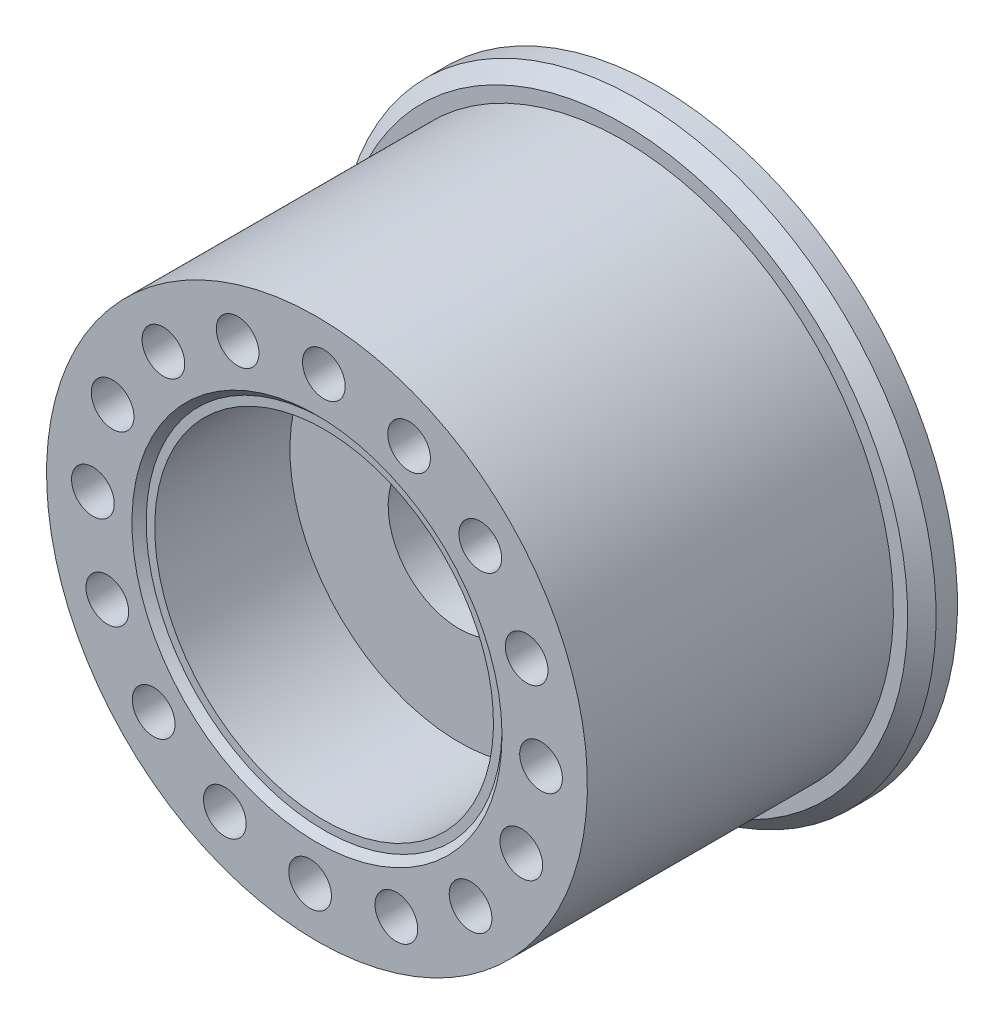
ISO-10303-21;
HEADER;
FILE_DESCRIPTION(('STEP AP214'),'2;1');
FILE_NAME('part.step','',(''),(''),'','','');
FILE_SCHEMA(('AUTOMOTIVE_DESIGN { 1 0 10303 214 1 1 1 1 }'));
ENDSEC;
DATA;
#1=APPLICATION_CONTEXT('core data for automotive mechanical design processes');
#2=APPLICATION_PROTOCOL_DEFINITION('international standard','automotive_design',2000,#1);
#3=PRODUCT_CONTEXT('',#1,'mechanical');
#4=PRODUCT('Part','Part','',(#3));
#5=PRODUCT_RELATED_PRODUCT_CATEGORY('part','',(#4));
#6=PRODUCT_DEFINITION_FORMATION('','',#4);
#7=PRODUCT_DEFINITION_CONTEXT('part definition',#1,'design');
#8=PRODUCT_DEFINITION('design','',#6,#7);
#9=PRODUCT_DEFINITION_SHAPE('','',#8);
#10=(LENGTH_UNIT() NAMED_UNIT(*) SI_UNIT(.MILLI.,.METRE.));
#11=(NAMED_UNIT(*) PLANE_ANGLE_UNIT() SI_UNIT($,.RADIAN.));
#12=(NAMED_UNIT(*) SI_UNIT($,.STERADIAN.) SOLID_ANGLE_UNIT());
#13=UNCERTAINTY_MEASURE_WITH_UNIT(LENGTH_MEASURE(1.E-05),#10,'distance_accuracy_value','');
#14=(GEOMETRIC_REPRESENTATION_CONTEXT(3) GLOBAL_UNCERTAINTY_ASSIGNED_CONTEXT((#13)) GLOBAL_UNIT_ASSIGNED_CONTEXT((#10,
#11,#12)) REPRESENTATION_CONTEXT('',''));
#15=CARTESIAN_POINT('',(0.,0.,0.));
#16=DIRECTION('',(0.,0.,1.));
#17=DIRECTION('',(1.,0.,0.));
#18=AXIS2_PLACEMENT_3D('',#15,#16,#17);
#19=CARTESIAN_POINT('',(780.987697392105,135.57859950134,19.999999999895));
#20=DIRECTION('',(0.,0.,-1.));
#21=DIRECTION('',(-0.99952767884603,0.0307314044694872,0.));
#22=AXIS2_PLACEMENT_3D('',#19,#20,#21);
#23=PLANE('',#22);
#24=CARTESIAN_POINT('',(780.621993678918,123.684220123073,19.999999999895));
#25=DIRECTION('',(0.,0.,-1.));
#26=DIRECTION('',(-0.99952767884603,0.0307314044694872,0.));
#27=AXIS2_PLACEMENT_3D('',#24,#25,#26);
#28=CIRCLE('',#27,5.);
#29=CARTESIAN_POINT('',(775.624355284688,123.83787714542,19.999999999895));
#30=VERTEX_POINT('',#29);
#31=EDGE_CURVE('E60',#30,#30,#28,.T.);
#32=ORIENTED_EDGE('',*,*,#31,.T.);
#33=EDGE_LOOP('',(#32));
#34=FACE_BOUND('',#33,.T.);
#35=CARTESIAN_POINT('',(780.621993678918,123.684220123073,19.999999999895));
#36=DIRECTION('',(0.,0.,-1.));
#37=DIRECTION('',(-0.99952767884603,0.0307314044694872,0.));
#38=AXIS2_PLACEMENT_3D('',#35,#36,#37);
#39=CIRCLE('',#38,11.9);
#40=CARTESIAN_POINT('',(768.72761430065,124.049923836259,19.999999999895));
#41=VERTEX_POINT('',#40);
#42=EDGE_CURVE('E10',#41,#41,#39,.T.);
#43=ORIENTED_EDGE('',*,*,#42,.F.);
#44=EDGE_LOOP('',(#43));
#45=FACE_BOUND('',#44,.T.);
#46=ADVANCED_FACE('F14',(#34,#45),#23,.F.);
#47=CARTESIAN_POINT('',(780.621993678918,123.684220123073,0.363724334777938));
#48=DIRECTION('',(0.,0.,-1.));
#49=DIRECTION('',(-0.99952767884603,0.0307314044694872,0.));
#50=AXIS2_PLACEMENT_3D('',#47,#48,#49);
#51=CYLINDRICAL_SURFACE('',#50,11.9);
#52=CARTESIAN_POINT('',(780.621993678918,123.684220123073,29.4999999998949));
#53=DIRECTION('',(0.,0.,-1.));
#54=DIRECTION('',(-0.99952767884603,0.0307314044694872,0.));
#55=AXIS2_PLACEMENT_3D('',#52,#53,#54);
#56=CIRCLE('',#55,11.9);
#57=CARTESIAN_POINT('',(768.72761430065,124.049923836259,29.4999999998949));
#58=VERTEX_POINT('',#57);
#59=EDGE_CURVE('E20',#58,#58,#56,.T.);
#60=ORIENTED_EDGE('',*,*,#59,.F.);
#61=EDGE_LOOP('',(#60));
#62=FACE_BOUND('',#61,.T.);
#63=ORIENTED_EDGE('',*,*,#42,.T.);
#64=EDGE_LOOP('',(#63));
#65=FACE_BOUND('',#64,.T.);
#66=ADVANCED_FACE('F212',(#62,#65),#51,.F.);
#67=CARTESIAN_POINT('',(781.006136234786,136.178316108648,29.4999999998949));
#68=DIRECTION('',(0.,0.,-1.));
#69=DIRECTION('',(-0.99952767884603,0.0307314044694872,0.));
#70=AXIS2_PLACEMENT_3D('',#67,#68,#69);
#71=PLANE('',#70);
#72=CARTESIAN_POINT('',(780.621993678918,123.684220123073,29.4999999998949));
#73=DIRECTION('',(0.,0.,-1.));
#74=DIRECTION('',(-0.99952767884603,0.0307314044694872,0.));
#75=AXIS2_PLACEMENT_3D('',#72,#73,#74);
#76=CIRCLE('',#75,12.5);
#77=CARTESIAN_POINT('',(768.127897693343,124.068362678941,29.4999999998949));
#78=VERTEX_POINT('',#77);
#79=EDGE_CURVE('E24',#78,#78,#76,.T.);
#80=ORIENTED_EDGE('',*,*,#79,.F.);
#81=EDGE_LOOP('',(#80));
#82=FACE_BOUND('',#81,.T.);
#83=ORIENTED_EDGE('',*,*,#59,.T.);
#84=EDGE_LOOP('',(#83));
#85=FACE_BOUND('',#84,.T.);
#86=ADVANCED_FACE('F207',(#82,#85),#71,.F.);
#87=CARTESIAN_POINT('',(780.621993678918,123.684220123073,29.4999999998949));
#88=DIRECTION('',(0.,0.,1.));
#89=DIRECTION('',(0.99952767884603,-0.0307314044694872,0.));
#90=AXIS2_PLACEMENT_3D('',#87,#88,#89);
#91=CONICAL_SURFACE('',#90,12.5,0.785398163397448);
#92=CARTESIAN_POINT('',(780.621993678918,123.684220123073,29.999999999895));
#93=DIRECTION('',(0.,0.,-1.));
#94=DIRECTION('',(-0.99952767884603,0.0307314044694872,0.));
#95=AXIS2_PLACEMENT_3D('',#92,#93,#94);
#96=CIRCLE('',#95,13.);
#97=CARTESIAN_POINT('',(767.62813385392,124.083728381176,29.999999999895));
#98=VERTEX_POINT('',#97);
#99=EDGE_CURVE('E28',#98,#98,#96,.T.);
#100=ORIENTED_EDGE('',*,*,#99,.F.);
#101=EDGE_LOOP('',(#100));
#102=FACE_BOUND('',#101,.T.);
#103=ORIENTED_EDGE('',*,*,#79,.T.);
#104=EDGE_LOOP('',(#103));
#105=FACE_BOUND('',#104,.T.);
#106=ADVANCED_FACE('F169',(#102,#105),#91,.F.);
#107=CARTESIAN_POINT('',(781.036867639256,137.177843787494,29.999999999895));
#108=DIRECTION('',(0.,0.,-1.));
#109=DIRECTION('',(-0.99952767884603,0.0307314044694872,0.));
#110=AXIS2_PLACEMENT_3D('',#107,#108,#109);
#111=PLANE('',#110);
#112=CARTESIAN_POINT('',(775.0447522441,138.413676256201,29.999999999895));
#113=DIRECTION('',(0.,0.,1.));
#114=DIRECTION('',(0.93520356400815,0.354110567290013,0.));
#115=AXIS2_PLACEMENT_3D('',#112,#113,#114);
#116=CIRCLE('',#115,1.5);
#117=CARTESIAN_POINT('',(776.447557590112,138.944842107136,29.999999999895));
#118=VERTEX_POINT('',#117);
#119=EDGE_CURVE('E159',#118,#118,#116,.T.);
#120=ORIENTED_EDGE('',*,*,#119,.F.);
#121=EDGE_LOOP('',(#120));
#122=FACE_BOUND('',#121,.T.);
#123=CARTESIAN_POINT('',(769.832575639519,135.158145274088,29.999999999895));
#124=DIRECTION('',(0.,0.,1.));
#125=DIRECTION('',(0.728503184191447,0.685042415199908,0.));
#126=AXIS2_PLACEMENT_3D('',#123,#124,#125);
#127=CIRCLE('',#126,1.5);
#128=CARTESIAN_POINT('',(770.925330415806,136.185708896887,29.999999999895));
#129=VERTEX_POINT('',#128);
#130=EDGE_CURVE('E153',#129,#129,#127,.T.);
#131=ORIENTED_EDGE('',*,*,#130,.F.);
#132=EDGE_LOOP('',(#131));
#133=FACE_BOUND('',#132,.T.);
#134=CARTESIAN_POINT('',(766.262990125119,130.155813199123,29.999999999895));
#135=DIRECTION('',(0.,0.,1.));
#136=DIRECTION('',(0.410894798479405,0.911682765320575,0.));
#137=AXIS2_PLACEMENT_3D('',#134,#135,#136);
#138=CIRCLE('',#137,1.5);
#139=CARTESIAN_POINT('',(766.879332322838,131.523337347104,29.999999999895));
#140=VERTEX_POINT('',#139);
#141=EDGE_CURVE('E147',#140,#140,#138,.T.);
#142=ORIENTED_EDGE('',*,*,#141,.F.);
#143=EDGE_LOOP('',(#142));
#144=FACE_BOUND('',#143,.T.);
#145=CARTESIAN_POINT('',(764.879432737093,124.168239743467,29.999999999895));
#146=DIRECTION('',(0.,0.,1.));
#147=DIRECTION('',(0.0307314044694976,0.99952767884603,0.));
#148=AXIS2_PLACEMENT_3D('',#145,#146,#147);
#149=CIRCLE('',#148,1.5);
#150=CARTESIAN_POINT('',(764.925529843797,125.667531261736,29.999999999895));
#151=VERTEX_POINT('',#150);
#152=EDGE_CURVE('E141',#151,#151,#149,.T.);
#153=ORIENTED_EDGE('',*,*,#152,.F.);
#154=EDGE_LOOP('',(#153));
#155=FACE_BOUND('',#154,.T.);
#156=CARTESIAN_POINT('',(765.892537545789,118.106978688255,29.999999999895));
#157=DIRECTION('',(0.,0.,1.));
#158=DIRECTION('',(-0.354110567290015,0.935203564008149,0.));
#159=AXIS2_PLACEMENT_3D('',#156,#157,#158);
#160=CIRCLE('',#159,1.5);
#161=CARTESIAN_POINT('',(765.361371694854,119.509784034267,29.999999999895));
#162=VERTEX_POINT('',#161);
#163=EDGE_CURVE('E135',#162,#162,#160,.T.);
#164=ORIENTED_EDGE('',*,*,#163,.F.);
#165=EDGE_LOOP('',(#164));
#166=FACE_BOUND('',#165,.T.);
#167=CARTESIAN_POINT('',(769.148068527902,112.894802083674,29.999999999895));
#168=DIRECTION('',(0.,0.,1.));
#169=DIRECTION('',(-0.68504241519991,0.728503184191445,0.));
#170=AXIS2_PLACEMENT_3D('',#167,#168,#169);
#171=CIRCLE('',#170,1.5);
#172=CARTESIAN_POINT('',(768.120504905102,113.987556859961,29.999999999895));
#173=VERTEX_POINT('',#172);
#174=EDGE_CURVE('E129',#173,#173,#171,.T.);
#175=ORIENTED_EDGE('',*,*,#174,.F.);
#176=EDGE_LOOP('',(#175));
#177=FACE_BOUND('',#176,.T.);
#178=CARTESIAN_POINT('',(774.150400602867,109.325216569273,29.999999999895));
#179=DIRECTION('',(0.,0.,1.));
#180=DIRECTION('',(-0.911682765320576,0.410894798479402,0.));
#181=AXIS2_PLACEMENT_3D('',#178,#179,#180);
#182=CIRCLE('',#181,1.5);
#183=CARTESIAN_POINT('',(772.782876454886,109.941558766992,29.999999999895));
#184=VERTEX_POINT('',#183);
#185=EDGE_CURVE('E123',#184,#184,#182,.T.);
#186=ORIENTED_EDGE('',*,*,#185,.F.);
#187=EDGE_LOOP('',(#186));
#188=FACE_BOUND('',#187,.T.);
#189=CARTESIAN_POINT('',(780.137974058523,107.941659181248,29.999999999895));
#190=DIRECTION('',(0.,0.,1.));
#191=DIRECTION('',(-0.99952767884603,0.0307314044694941,0.));
#192=AXIS2_PLACEMENT_3D('',#189,#190,#191);
#193=CIRCLE('',#192,1.5);
#194=CARTESIAN_POINT('',(778.638682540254,107.987756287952,29.999999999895));
#195=VERTEX_POINT('',#194);
#196=EDGE_CURVE('E117',#195,#195,#193,.T.);
#197=ORIENTED_EDGE('',*,*,#196,.F.);
#198=EDGE_LOOP('',(#197));
#199=FACE_BOUND('',#198,.T.);
#200=CARTESIAN_POINT('',(786.199235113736,108.954763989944,29.999999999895));
#201=DIRECTION('',(0.,0.,1.));
#202=DIRECTION('',(-0.935203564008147,-0.354110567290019,0.));
#203=AXIS2_PLACEMENT_3D('',#200,#201,#202);
#204=CIRCLE('',#203,1.5);
#205=CARTESIAN_POINT('',(784.796429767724,108.423598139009,29.999999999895));
#206=VERTEX_POINT('',#205);
#207=EDGE_CURVE('E111',#206,#206,#204,.T.);
#208=ORIENTED_EDGE('',*,*,#207,.F.);
#209=EDGE_LOOP('',(#208));
#210=FACE_BOUND('',#209,.T.);
#211=CARTESIAN_POINT('',(791.411411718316,112.210294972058,29.999999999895));
#212=DIRECTION('',(0.,0.,1.));
#213=DIRECTION('',(-0.728503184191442,-0.685042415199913,0.));
#214=AXIS2_PLACEMENT_3D('',#211,#212,#213);
#215=CIRCLE('',#214,1.5);
#216=CARTESIAN_POINT('',(790.318656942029,111.182731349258,29.999999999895));
#217=VERTEX_POINT('',#216);
#218=EDGE_CURVE('E105',#217,#217,#215,.T.);
#219=ORIENTED_EDGE('',*,*,#218,.F.);
#220=EDGE_LOOP('',(#219));
#221=FACE_BOUND('',#220,.T.);
#222=CARTESIAN_POINT('',(794.980997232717,117.212627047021,29.999999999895));
#223=DIRECTION('',(0.,0.,1.));
#224=DIRECTION('',(-0.4108947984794,-0.911682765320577,0.));
#225=AXIS2_PLACEMENT_3D('',#222,#223,#224);
#226=CIRCLE('',#225,1.5);
#227=CARTESIAN_POINT('',(794.364655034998,115.845102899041,29.999999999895));
#228=VERTEX_POINT('',#227);
#229=EDGE_CURVE('E99',#228,#228,#226,.T.);
#230=ORIENTED_EDGE('',*,*,#229,.F.);
#231=EDGE_LOOP('',(#230));
#232=FACE_BOUND('',#231,.T.);
#233=CARTESIAN_POINT('',(796.364554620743,123.200200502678,29.999999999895));
#234=DIRECTION('',(0.,0.,1.));
#235=DIRECTION('',(-0.0307314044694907,-0.99952767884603,0.));
#236=AXIS2_PLACEMENT_3D('',#233,#234,#235);
#237=CIRCLE('',#236,1.5);
#238=CARTESIAN_POINT('',(796.318457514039,121.700908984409,29.999999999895));
#239=VERTEX_POINT('',#238);
#240=EDGE_CURVE('E93',#239,#239,#237,.T.);
#241=ORIENTED_EDGE('',*,*,#240,.F.);
#242=EDGE_LOOP('',(#241));
#243=FACE_BOUND('',#242,.T.);
#244=CARTESIAN_POINT('',(795.351449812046,129.26146155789,29.999999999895));
#245=DIRECTION('',(0.,0.,1.));
#246=DIRECTION('',(0.354110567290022,-0.935203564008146,0.));
#247=AXIS2_PLACEMENT_3D('',#244,#245,#246);
#248=CIRCLE('',#247,1.5);
#249=CARTESIAN_POINT('',(795.882615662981,127.858656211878,29.999999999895));
#250=VERTEX_POINT('',#249);
#251=EDGE_CURVE('E87',#250,#250,#248,.T.);
#252=ORIENTED_EDGE('',*,*,#251,.F.);
#253=EDGE_LOOP('',(#252));
#254=FACE_BOUND('',#253,.T.);
#255=CARTESIAN_POINT('',(792.095918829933,134.473638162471,29.999999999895));
#256=DIRECTION('',(0.,0.,1.));
#257=DIRECTION('',(0.685042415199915,-0.72850318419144,0.));
#258=AXIS2_PLACEMENT_3D('',#255,#256,#257);
#259=CIRCLE('',#258,1.5);
#260=CARTESIAN_POINT('',(793.123482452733,133.380883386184,29.999999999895));
#261=VERTEX_POINT('',#260);
#262=EDGE_CURVE('E81',#261,#261,#259,.T.);
#263=ORIENTED_EDGE('',*,*,#262,.F.);
#264=EDGE_LOOP('',(#263));
#265=FACE_BOUND('',#264,.T.);
#266=CARTESIAN_POINT('',(787.093586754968,138.043223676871,29.999999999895));
#267=DIRECTION('',(0.,0.,1.));
#268=DIRECTION('',(0.911682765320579,-0.410894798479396,0.));
#269=AXIS2_PLACEMENT_3D('',#266,#267,#268);
#270=CIRCLE('',#269,1.5);
#271=CARTESIAN_POINT('',(788.461110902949,137.426881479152,29.999999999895));
#272=VERTEX_POINT('',#271);
#273=EDGE_CURVE('E75',#272,#272,#270,.T.);
#274=ORIENTED_EDGE('',*,*,#273,.F.);
#275=EDGE_LOOP('',(#274));
#276=FACE_BOUND('',#275,.T.);
#277=CARTESIAN_POINT('',(781.106013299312,139.426781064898,29.999999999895));
#278=DIRECTION('',(0.,0.,1.));
#279=DIRECTION('',(0.99952767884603,-0.0307314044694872,0.));
#280=AXIS2_PLACEMENT_3D('',#277,#278,#279);
#281=CIRCLE('',#280,1.5);
#282=CARTESIAN_POINT('',(782.605304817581,139.380683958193,29.999999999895));
#283=VERTEX_POINT('',#282);
#284=EDGE_CURVE('E69',#283,#283,#281,.T.);
#285=ORIENTED_EDGE('',*,*,#284,.F.);
#286=EDGE_LOOP('',(#285));
#287=FACE_BOUND('',#286,.T.);
#288=CARTESIAN_POINT('',(780.621993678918,123.684220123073,29.999999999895));
#289=DIRECTION('',(0.,0.,-1.));
#290=DIRECTION('',(-0.99952767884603,0.0307314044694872,0.));
#291=AXIS2_PLACEMENT_3D('',#288,#289,#290);
#292=CIRCLE('',#291,19.);
#293=CARTESIAN_POINT('',(761.630967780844,124.268116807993,29.999999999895));
#294=VERTEX_POINT('',#293);
#295=EDGE_CURVE('E33',#294,#294,#292,.T.);
#296=ORIENTED_EDGE('',*,*,#295,.F.);
#297=EDGE_LOOP('',(#296));
#298=FACE_BOUND('',#297,.T.);
#299=ORIENTED_EDGE('',*,*,#99,.T.);
#300=EDGE_LOOP('',(#299));
#301=FACE_BOUND('',#300,.T.);
#302=ADVANCED_FACE('F165',(#122,#133,#144,#155,#166,#177,#188,#199,#210,#221,#232,#243,#254,
#265,#276,#287,#298,#301),#111,.F.);
#303=CARTESIAN_POINT('',(780.621993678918,123.684220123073,0.363724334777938));
#304=DIRECTION('',(0.,0.,-1.));
#305=DIRECTION('',(-0.99952767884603,0.0307314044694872,0.));
#306=AXIS2_PLACEMENT_3D('',#303,#304,#305);
#307=CYLINDRICAL_SURFACE('',#306,19.);
#308=CARTESIAN_POINT('',(780.621993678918,123.684220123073,8.49999999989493));
#309=DIRECTION('',(0.,0.,-1.));
#310=DIRECTION('',(-0.99952767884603,0.0307314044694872,0.));
#311=AXIS2_PLACEMENT_3D('',#308,#309,#310);
#312=CIRCLE('',#311,19.);
#313=CARTESIAN_POINT('',(761.630967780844,124.268116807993,8.49999999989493));
#314=VERTEX_POINT('',#313);
#315=EDGE_CURVE('E36',#314,#314,#312,.T.);
#316=ORIENTED_EDGE('',*,*,#315,.F.);
#317=EDGE_LOOP('',(#316));
#318=FACE_BOUND('',#317,.T.);
#319=ORIENTED_EDGE('',*,*,#295,.T.);
#320=EDGE_LOOP('',(#319));
#321=FACE_BOUND('',#320,.T.);
#322=ADVANCED_FACE('F168',(#318,#321),#307,.T.);
#323=CARTESIAN_POINT('',(781.236621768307,143.674773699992,8.49999999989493));
#324=DIRECTION('',(0.,0.,-1.));
#325=DIRECTION('',(-0.99952767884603,0.0307314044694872,0.));
#326=AXIS2_PLACEMENT_3D('',#323,#324,#325);
#327=PLANE('',#326);
#328=CARTESIAN_POINT('',(780.621993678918,123.684220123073,8.49999999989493));
#329=DIRECTION('',(0.,0.,-1.));
#330=DIRECTION('',(-0.99952767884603,0.0307314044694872,0.));
#331=AXIS2_PLACEMENT_3D('',#328,#329,#330);
#332=CIRCLE('',#331,19.9999999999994);
#333=CARTESIAN_POINT('',(760.631440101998,124.298848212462,8.49999999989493));
#334=VERTEX_POINT('',#333);
#335=EDGE_CURVE('E39',#334,#334,#332,.T.);
#336=ORIENTED_EDGE('',*,*,#335,.F.);
#337=EDGE_LOOP('',(#336));
#338=FACE_BOUND('',#337,.T.);
#339=ORIENTED_EDGE('',*,*,#315,.T.);
#340=EDGE_LOOP('',(#339));
#341=FACE_BOUND('',#340,.T.);
#342=ADVANCED_FACE('F266',(#338,#341),#327,.F.);
#343=CARTESIAN_POINT('',(780.621993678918,123.684220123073,8.49999999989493));
#344=DIRECTION('',(0.,0.,-1.));
#345=DIRECTION('',(-0.99952767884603,0.0307314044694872,0.));
#346=AXIS2_PLACEMENT_3D('',#343,#344,#345);
#347=CONICAL_SURFACE('',#346,19.9999999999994,0.785398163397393);
#348=CARTESIAN_POINT('',(780.621993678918,123.684220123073,7.49999999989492));
#349=DIRECTION('',(0.,0.,-1.));
#350=DIRECTION('',(-0.99952767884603,0.0307314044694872,0.));
#351=AXIS2_PLACEMENT_3D('',#348,#349,#350);
#352=CIRCLE('',#351,20.9999999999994);
#353=CARTESIAN_POINT('',(759.631912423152,124.329579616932,7.49999999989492));
#354=VERTEX_POINT('',#353);
#355=EDGE_CURVE('E42',#354,#354,#352,.T.);
#356=ORIENTED_EDGE('',*,*,#355,.F.);
#357=EDGE_LOOP('',(#356));
#358=FACE_BOUND('',#357,.T.);
#359=ORIENTED_EDGE('',*,*,#335,.T.);
#360=EDGE_LOOP('',(#359));
#361=FACE_BOUND('',#360,.T.);
#362=ADVANCED_FACE('F262',(#358,#361),#347,.T.);
#363=CARTESIAN_POINT('',(780.621993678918,123.684220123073,0.363724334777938));
#364=DIRECTION('',(0.,0.,-1.));
#365=DIRECTION('',(-0.99952767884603,0.0307314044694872,0.));
#366=AXIS2_PLACEMENT_3D('',#363,#364,#365);
#367=CYLINDRICAL_SURFACE('',#366,20.9999999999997);
#368=CARTESIAN_POINT('',(780.621993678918,123.684220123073,5.99999999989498));
#369=DIRECTION('',(0.,0.,-1.));
#370=DIRECTION('',(-0.99952767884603,0.0307314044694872,0.));
#371=AXIS2_PLACEMENT_3D('',#368,#369,#370);
#372=CIRCLE('',#371,21.);
#373=CARTESIAN_POINT('',(759.631912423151,124.329579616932,5.99999999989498));
#374=VERTEX_POINT('',#373);
#375=EDGE_CURVE('E45',#374,#374,#372,.T.);
#376=ORIENTED_EDGE('',*,*,#375,.F.);
#377=EDGE_LOOP('',(#376));
#378=FACE_BOUND('',#377,.T.);
#379=ORIENTED_EDGE('',*,*,#355,.T.);
#380=EDGE_LOOP('',(#379));
#381=FACE_BOUND('',#380,.T.);
#382=ADVANCED_FACE('F258',(#378,#381),#367,.T.);
#383=CARTESIAN_POINT('',(781.267353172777,144.674301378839,5.99999999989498));
#384=DIRECTION('',(0.,0.,1.));
#385=DIRECTION('',(0.99952767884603,-0.0307314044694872,0.));
#386=AXIS2_PLACEMENT_3D('',#383,#384,#385);
#387=PLANE('',#386);
#388=CARTESIAN_POINT('',(780.621993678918,123.684220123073,5.99999999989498));
#389=DIRECTION('',(0.,0.,-1.));
#390=DIRECTION('',(-0.99952767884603,0.0307314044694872,0.));
#391=AXIS2_PLACEMENT_3D('',#388,#389,#390);
#392=CIRCLE('',#391,13.);
#393=CARTESIAN_POINT('',(767.62813385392,124.083728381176,5.99999999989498));
#394=VERTEX_POINT('',#393);
#395=EDGE_CURVE('E48',#394,#394,#392,.T.);
#396=ORIENTED_EDGE('',*,*,#395,.F.);
#397=EDGE_LOOP('',(#396));
#398=FACE_BOUND('',#397,.T.);
#399=ORIENTED_EDGE('',*,*,#375,.T.);
#400=EDGE_LOOP('',(#399));
#401=FACE_BOUND('',#400,.T.);
#402=ADVANCED_FACE('F254',(#398,#401),#387,.F.);
#403=CARTESIAN_POINT('',(780.621993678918,123.684220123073,5.99999999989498));
#404=DIRECTION('',(0.,0.,-1.));
#405=DIRECTION('',(-0.99952767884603,0.0307314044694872,0.));
#406=AXIS2_PLACEMENT_3D('',#403,#404,#405);
#407=CONICAL_SURFACE('',#406,13.,0.785398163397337);
#408=CARTESIAN_POINT('',(780.621993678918,123.684220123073,6.49999999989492));
#409=DIRECTION('',(0.,0.,-1.));
#410=DIRECTION('',(-0.99952767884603,0.0307314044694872,0.));
#411=AXIS2_PLACEMENT_3D('',#408,#409,#410);
#412=CIRCLE('',#411,12.5);
#413=CARTESIAN_POINT('',(768.127897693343,124.068362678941,6.49999999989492));
#414=VERTEX_POINT('',#413);
#415=EDGE_CURVE('E51',#414,#414,#412,.T.);
#416=ORIENTED_EDGE('',*,*,#415,.F.);
#417=EDGE_LOOP('',(#416));
#418=FACE_BOUND('',#417,.T.);
#419=ORIENTED_EDGE('',*,*,#395,.T.);
#420=EDGE_LOOP('',(#419));
#421=FACE_BOUND('',#420,.T.);
#422=ADVANCED_FACE('F250',(#418,#421),#407,.F.);
#423=CARTESIAN_POINT('',(781.006136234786,136.178316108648,6.49999999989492));
#424=DIRECTION('',(0.,0.,1.));
#425=DIRECTION('',(0.99952767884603,-0.0307314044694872,0.));
#426=AXIS2_PLACEMENT_3D('',#423,#424,#425);
#427=PLANE('',#426);
#428=CARTESIAN_POINT('',(780.621993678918,123.684220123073,6.49999999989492));
#429=DIRECTION('',(0.,0.,-1.));
#430=DIRECTION('',(-0.99952767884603,0.0307314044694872,0.));
#431=AXIS2_PLACEMENT_3D('',#428,#429,#430);
#432=CIRCLE('',#431,11.9);
#433=CARTESIAN_POINT('',(768.72761430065,124.049923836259,6.49999999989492));
#434=VERTEX_POINT('',#433);
#435=EDGE_CURVE('E54',#434,#434,#432,.T.);
#436=ORIENTED_EDGE('',*,*,#435,.F.);
#437=EDGE_LOOP('',(#436));
#438=FACE_BOUND('',#437,.T.);
#439=ORIENTED_EDGE('',*,*,#415,.T.);
#440=EDGE_LOOP('',(#439));
#441=FACE_BOUND('',#440,.T.);
#442=ADVANCED_FACE('F246',(#438,#441),#427,.F.);
#443=CARTESIAN_POINT('',(780.621993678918,123.684220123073,0.363724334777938));
#444=DIRECTION('',(0.,0.,-1.));
#445=DIRECTION('',(-0.99952767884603,0.0307314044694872,0.));
#446=AXIS2_PLACEMENT_3D('',#443,#444,#445);
#447=CYLINDRICAL_SURFACE('',#446,11.9);
#448=CARTESIAN_POINT('',(780.621993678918,123.684220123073,11.999999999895));
#449=DIRECTION('',(0.,0.,-1.));
#450=DIRECTION('',(-0.99952767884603,0.0307314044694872,0.));
#451=AXIS2_PLACEMENT_3D('',#448,#449,#450);
#452=CIRCLE('',#451,11.9);
#453=CARTESIAN_POINT('',(768.72761430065,124.049923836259,11.999999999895));
#454=VERTEX_POINT('',#453);
#455=EDGE_CURVE('E57',#454,#454,#452,.T.);
#456=ORIENTED_EDGE('',*,*,#455,.F.);
#457=EDGE_LOOP('',(#456));
#458=FACE_BOUND('',#457,.T.);
#459=ORIENTED_EDGE('',*,*,#435,.T.);
#460=EDGE_LOOP('',(#459));
#461=FACE_BOUND('',#460,.T.);
#462=ADVANCED_FACE('F239',(#458,#461),#447,.F.);
#463=CARTESIAN_POINT('',(780.987697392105,135.57859950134,11.999999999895));
#464=DIRECTION('',(0.,0.,1.));
#465=DIRECTION('',(0.99952767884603,-0.0307314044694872,0.));
#466=AXIS2_PLACEMENT_3D('',#463,#464,#465);
#467=PLANE('',#466);
#468=CARTESIAN_POINT('',(780.621993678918,123.684220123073,11.999999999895));
#469=DIRECTION('',(0.,0.,-1.));
#470=DIRECTION('',(-0.99952767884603,0.0307314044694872,0.));
#471=AXIS2_PLACEMENT_3D('',#468,#469,#470);
#472=CIRCLE('',#471,5.);
#473=CARTESIAN_POINT('',(775.624355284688,123.83787714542,11.999999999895));
#474=VERTEX_POINT('',#473);
#475=EDGE_CURVE('E63',#474,#474,#472,.T.);
#476=ORIENTED_EDGE('',*,*,#475,.F.);
#477=EDGE_LOOP('',(#476));
#478=FACE_BOUND('',#477,.T.);
#479=ORIENTED_EDGE('',*,*,#455,.T.);
#480=EDGE_LOOP('',(#479));
#481=FACE_BOUND('',#480,.T.);
#482=ADVANCED_FACE('F229',(#478,#481),#467,.F.);
#483=CARTESIAN_POINT('',(780.621993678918,123.684220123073,29.999999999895));
#484=DIRECTION('',(0.,0.,-1.));
#485=DIRECTION('',(-0.99952767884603,0.0307314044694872,0.));
#486=AXIS2_PLACEMENT_3D('',#483,#484,#485);
#487=CYLINDRICAL_SURFACE('',#486,5.);
#488=ORIENTED_EDGE('',*,*,#475,.T.);
#489=EDGE_LOOP('',(#488));
#490=FACE_BOUND('',#489,.T.);
#491=ORIENTED_EDGE('',*,*,#31,.F.);
#492=EDGE_LOOP('',(#491));
#493=FACE_BOUND('',#492,.T.);
#494=ADVANCED_FACE('F226',(#490,#493),#487,.F.);
#495=CARTESIAN_POINT('',(781.106013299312,139.426781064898,8.49999999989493));
#496=DIRECTION('',(0.,0.,1.));
#497=DIRECTION('',(0.99952767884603,-0.0307314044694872,0.));
#498=AXIS2_PLACEMENT_3D('',#495,#496,#497);
#499=CYLINDRICAL_SURFACE('',#498,1.5);
#500=CARTESIAN_POINT('',(781.106013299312,139.426781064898,8.49999999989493));
#501=DIRECTION('',(0.,0.,1.));
#502=DIRECTION('',(0.99952767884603,-0.0307314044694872,0.));
#503=AXIS2_PLACEMENT_3D('',#500,#501,#502);
#504=CIRCLE('',#503,1.5);
#505=CARTESIAN_POINT('',(782.605304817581,139.380683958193,8.49999999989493));
#506=VERTEX_POINT('',#505);
#507=EDGE_CURVE('E66',#506,#506,#504,.T.);
#508=ORIENTED_EDGE('',*,*,#507,.F.);
#509=EDGE_LOOP('',(#508));
#510=FACE_BOUND('',#509,.T.);
#511=ORIENTED_EDGE('',*,*,#284,.T.);
#512=EDGE_LOOP('',(#511));
#513=FACE_BOUND('',#512,.T.);
#514=ADVANCED_FACE('F228',(#510,#513),#499,.F.);
#515=CARTESIAN_POINT('',(781.106013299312,139.426781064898,8.49999999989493));
#516=DIRECTION('',(0.,0.,1.));
#517=DIRECTION('',(0.99952767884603,-0.0307314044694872,0.));
#518=AXIS2_PLACEMENT_3D('',#515,#516,#517);
#519=PLANE('',#518);
#520=ORIENTED_EDGE('',*,*,#507,.T.);
#521=EDGE_LOOP('',(#520));
#522=FACE_BOUND('',#521,.T.);
#523=ADVANCED_FACE('F236',(#522),#519,.T.);
#524=CARTESIAN_POINT('',(787.093586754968,138.043223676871,8.49999999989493));
#525=DIRECTION('',(0.,0.,1.));
#526=DIRECTION('',(0.99952767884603,-0.0307314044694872,0.));
#527=AXIS2_PLACEMENT_3D('',#524,#525,#526);
#528=CYLINDRICAL_SURFACE('',#527,1.5);
#529=CARTESIAN_POINT('',(787.093586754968,138.043223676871,8.49999999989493));
#530=DIRECTION('',(0.,0.,1.));
#531=DIRECTION('',(0.911682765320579,-0.410894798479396,0.));
#532=AXIS2_PLACEMENT_3D('',#529,#530,#531);
#533=CIRCLE('',#532,1.5);
#534=CARTESIAN_POINT('',(788.461110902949,137.426881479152,8.49999999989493));
#535=VERTEX_POINT('',#534);
#536=EDGE_CURVE('E72',#535,#535,#533,.T.);
#537=ORIENTED_EDGE('',*,*,#536,.F.);
#538=EDGE_LOOP('',(#537));
#539=FACE_BOUND('',#538,.T.);
#540=ORIENTED_EDGE('',*,*,#273,.T.);
#541=EDGE_LOOP('',(#540));
#542=FACE_BOUND('',#541,.T.);
#543=ADVANCED_FACE('F346',(#539,#542),#528,.F.);
#544=CARTESIAN_POINT('',(787.093586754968,138.043223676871,8.49999999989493));
#545=DIRECTION('',(0.,0.,1.));
#546=DIRECTION('',(0.911682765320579,-0.410894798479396,0.));
#547=AXIS2_PLACEMENT_3D('',#544,#545,#546);
#548=PLANE('',#547);
#549=ORIENTED_EDGE('',*,*,#536,.T.);
#550=EDGE_LOOP('',(#549));
#551=FACE_BOUND('',#550,.T.);
#552=ADVANCED_FACE('F355',(#551),#548,.T.);
#553=CARTESIAN_POINT('',(792.095918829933,134.473638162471,8.49999999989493));
#554=DIRECTION('',(0.,0.,1.));
#555=DIRECTION('',(0.99952767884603,-0.0307314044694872,0.));
#556=AXIS2_PLACEMENT_3D('',#553,#554,#555);
#557=CYLINDRICAL_SURFACE('',#556,1.5);
#558=CARTESIAN_POINT('',(792.095918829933,134.473638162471,8.49999999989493));
#559=DIRECTION('',(0.,0.,1.));
#560=DIRECTION('',(0.685042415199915,-0.72850318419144,0.));
#561=AXIS2_PLACEMENT_3D('',#558,#559,#560);
#562=CIRCLE('',#561,1.5);
#563=CARTESIAN_POINT('',(793.123482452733,133.380883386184,8.49999999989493));
#564=VERTEX_POINT('',#563);
#565=EDGE_CURVE('E78',#564,#564,#562,.T.);
#566=ORIENTED_EDGE('',*,*,#565,.F.);
#567=EDGE_LOOP('',(#566));
#568=FACE_BOUND('',#567,.T.);
#569=ORIENTED_EDGE('',*,*,#262,.T.);
#570=EDGE_LOOP('',(#569));
#571=FACE_BOUND('',#570,.T.);
#572=ADVANCED_FACE('F365',(#568,#571),#557,.F.);
#573=CARTESIAN_POINT('',(792.095918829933,134.473638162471,8.49999999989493));
#574=DIRECTION('',(0.,0.,1.));
#575=DIRECTION('',(0.685042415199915,-0.72850318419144,0.));
#576=AXIS2_PLACEMENT_3D('',#573,#574,#575);
#577=PLANE('',#576);
#578=ORIENTED_EDGE('',*,*,#565,.T.);
#579=EDGE_LOOP('',(#578));
#580=FACE_BOUND('',#579,.T.);
#581=ADVANCED_FACE('F375',(#580),#577,.T.);
#582=CARTESIAN_POINT('',(795.351449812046,129.26146155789,8.49999999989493));
#583=DIRECTION('',(0.,0.,1.));
#584=DIRECTION('',(0.99952767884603,-0.0307314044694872,0.));
#585=AXIS2_PLACEMENT_3D('',#582,#583,#584);
#586=CYLINDRICAL_SURFACE('',#585,1.5);
#587=CARTESIAN_POINT('',(795.351449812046,129.26146155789,8.49999999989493));
#588=DIRECTION('',(0.,0.,1.));
#589=DIRECTION('',(0.354110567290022,-0.935203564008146,0.));
#590=AXIS2_PLACEMENT_3D('',#587,#588,#589);
#591=CIRCLE('',#590,1.5);
#592=CARTESIAN_POINT('',(795.882615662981,127.858656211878,8.49999999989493));
#593=VERTEX_POINT('',#592);
#594=EDGE_CURVE('E84',#593,#593,#591,.T.);
#595=ORIENTED_EDGE('',*,*,#594,.F.);
#596=EDGE_LOOP('',(#595));
#597=FACE_BOUND('',#596,.T.);
#598=ORIENTED_EDGE('',*,*,#251,.T.);
#599=EDGE_LOOP('',(#598));
#600=FACE_BOUND('',#599,.T.);
#601=ADVANCED_FACE('F385',(#597,#600),#586,.F.);
#602=CARTESIAN_POINT('',(795.351449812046,129.26146155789,8.49999999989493));
#603=DIRECTION('',(0.,0.,1.));
#604=DIRECTION('',(0.354110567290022,-0.935203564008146,0.));
#605=AXIS2_PLACEMENT_3D('',#602,#603,#604);
#606=PLANE('',#605);
#607=ORIENTED_EDGE('',*,*,#594,.T.);
#608=EDGE_LOOP('',(#607));
#609=FACE_BOUND('',#608,.T.);
#610=ADVANCED_FACE('F395',(#609),#606,.T.);
#611=CARTESIAN_POINT('',(796.364554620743,123.200200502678,8.49999999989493));
#612=DIRECTION('',(0.,0.,1.));
#613=DIRECTION('',(0.99952767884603,-0.0307314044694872,0.));
#614=AXIS2_PLACEMENT_3D('',#611,#612,#613);
#615=CYLINDRICAL_SURFACE('',#614,1.5);
#616=CARTESIAN_POINT('',(796.364554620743,123.200200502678,8.49999999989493));
#617=DIRECTION('',(0.,0.,1.));
#618=DIRECTION('',(-0.0307314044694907,-0.99952767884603,0.));
#619=AXIS2_PLACEMENT_3D('',#616,#617,#618);
#620=CIRCLE('',#619,1.5);
#621=CARTESIAN_POINT('',(796.318457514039,121.700908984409,8.49999999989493));
#622=VERTEX_POINT('',#621);
#623=EDGE_CURVE('E90',#622,#622,#620,.T.);
#624=ORIENTED_EDGE('',*,*,#623,.F.);
#625=EDGE_LOOP('',(#624));
#626=FACE_BOUND('',#625,.T.);
#627=ORIENTED_EDGE('',*,*,#240,.T.);
#628=EDGE_LOOP('',(#627));
#629=FACE_BOUND('',#628,.T.);
#630=ADVANCED_FACE('F405',(#626,#629),#615,.F.);
#631=CARTESIAN_POINT('',(796.364554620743,123.200200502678,8.49999999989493));
#632=DIRECTION('',(0.,0.,1.));
#633=DIRECTION('',(-0.0307314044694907,-0.99952767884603,0.));
#634=AXIS2_PLACEMENT_3D('',#631,#632,#633);
#635=PLANE('',#634);
#636=ORIENTED_EDGE('',*,*,#623,.T.);
#637=EDGE_LOOP('',(#636));
#638=FACE_BOUND('',#637,.T.);
#639=ADVANCED_FACE('F415',(#638),#635,.T.);
#640=CARTESIAN_POINT('',(794.980997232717,117.212627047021,8.49999999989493));
#641=DIRECTION('',(0.,0.,1.));
#642=DIRECTION('',(0.99952767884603,-0.0307314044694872,0.));
#643=AXIS2_PLACEMENT_3D('',#640,#641,#642);
#644=CYLINDRICAL_SURFACE('',#643,1.5);
#645=CARTESIAN_POINT('',(794.980997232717,117.212627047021,8.49999999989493));
#646=DIRECTION('',(0.,0.,1.));
#647=DIRECTION('',(-0.4108947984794,-0.911682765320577,0.));
#648=AXIS2_PLACEMENT_3D('',#645,#646,#647);
#649=CIRCLE('',#648,1.5);
#650=CARTESIAN_POINT('',(794.364655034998,115.845102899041,8.49999999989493));
#651=VERTEX_POINT('',#650);
#652=EDGE_CURVE('E96',#651,#651,#649,.T.);
#653=ORIENTED_EDGE('',*,*,#652,.F.);
#654=EDGE_LOOP('',(#653));
#655=FACE_BOUND('',#654,.T.);
#656=ORIENTED_EDGE('',*,*,#229,.T.);
#657=EDGE_LOOP('',(#656));
#658=FACE_BOUND('',#657,.T.);
#659=ADVANCED_FACE('F425',(#655,#658),#644,.F.);
#660=CARTESIAN_POINT('',(794.980997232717,117.212627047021,8.49999999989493));
#661=DIRECTION('',(0.,0.,1.));
#662=DIRECTION('',(-0.4108947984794,-0.911682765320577,0.));
#663=AXIS2_PLACEMENT_3D('',#660,#661,#662);
#664=PLANE('',#663);
#665=ORIENTED_EDGE('',*,*,#652,.T.);
#666=EDGE_LOOP('',(#665));
#667=FACE_BOUND('',#666,.T.);
#668=ADVANCED_FACE('F435',(#667),#664,.T.);
#669=CARTESIAN_POINT('',(791.411411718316,112.210294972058,8.49999999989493));
#670=DIRECTION('',(0.,0.,1.));
#671=DIRECTION('',(0.99952767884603,-0.0307314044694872,0.));
#672=AXIS2_PLACEMENT_3D('',#669,#670,#671);
#673=CYLINDRICAL_SURFACE('',#672,1.5);
#674=CARTESIAN_POINT('',(791.411411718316,112.210294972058,8.49999999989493));
#675=DIRECTION('',(0.,0.,1.));
#676=DIRECTION('',(-0.728503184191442,-0.685042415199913,0.));
#677=AXIS2_PLACEMENT_3D('',#674,#675,#676);
#678=CIRCLE('',#677,1.5);
#679=CARTESIAN_POINT('',(790.318656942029,111.182731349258,8.49999999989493));
#680=VERTEX_POINT('',#679);
#681=EDGE_CURVE('E102',#680,#680,#678,.T.);
#682=ORIENTED_EDGE('',*,*,#681,.F.);
#683=EDGE_LOOP('',(#682));
#684=FACE_BOUND('',#683,.T.);
#685=ORIENTED_EDGE('',*,*,#218,.T.);
#686=EDGE_LOOP('',(#685));
#687=FACE_BOUND('',#686,.T.);
#688=ADVANCED_FACE('F445',(#684,#687),#673,.F.);
#689=CARTESIAN_POINT('',(791.411411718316,112.210294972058,8.49999999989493));
#690=DIRECTION('',(0.,0.,1.));
#691=DIRECTION('',(-0.728503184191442,-0.685042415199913,0.));
#692=AXIS2_PLACEMENT_3D('',#689,#690,#691);
#693=PLANE('',#692);
#694=ORIENTED_EDGE('',*,*,#681,.T.);
#695=EDGE_LOOP('',(#694));
#696=FACE_BOUND('',#695,.T.);
#697=ADVANCED_FACE('F455',(#696),#693,.T.);
#698=CARTESIAN_POINT('',(786.199235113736,108.954763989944,8.49999999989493));
#699=DIRECTION('',(0.,0.,1.));
#700=DIRECTION('',(0.99952767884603,-0.0307314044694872,0.));
#701=AXIS2_PLACEMENT_3D('',#698,#699,#700);
#702=CYLINDRICAL_SURFACE('',#701,1.5);
#703=CARTESIAN_POINT('',(786.199235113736,108.954763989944,8.49999999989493));
#704=DIRECTION('',(0.,0.,1.));
#705=DIRECTION('',(-0.935203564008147,-0.354110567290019,0.));
#706=AXIS2_PLACEMENT_3D('',#703,#704,#705);
#707=CIRCLE('',#706,1.5);
#708=CARTESIAN_POINT('',(784.796429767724,108.423598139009,8.49999999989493));
#709=VERTEX_POINT('',#708);
#710=EDGE_CURVE('E108',#709,#709,#707,.T.);
#711=ORIENTED_EDGE('',*,*,#710,.F.);
#712=EDGE_LOOP('',(#711));
#713=FACE_BOUND('',#712,.T.);
#714=ORIENTED_EDGE('',*,*,#207,.T.);
#715=EDGE_LOOP('',(#714));
#716=FACE_BOUND('',#715,.T.);
#717=ADVANCED_FACE('F465',(#713,#716),#702,.F.);
#718=CARTESIAN_POINT('',(786.199235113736,108.954763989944,8.49999999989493));
#719=DIRECTION('',(0.,0.,1.));
#720=DIRECTION('',(-0.935203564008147,-0.354110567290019,0.));
#721=AXIS2_PLACEMENT_3D('',#718,#719,#720);
#722=PLANE('',#721);
#723=ORIENTED_EDGE('',*,*,#710,.T.);
#724=EDGE_LOOP('',(#723));
#725=FACE_BOUND('',#724,.T.);
#726=ADVANCED_FACE('F475',(#725),#722,.T.);
#727=CARTESIAN_POINT('',(780.137974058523,107.941659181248,8.49999999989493));
#728=DIRECTION('',(0.,0.,1.));
#729=DIRECTION('',(0.99952767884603,-0.0307314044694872,0.));
#730=AXIS2_PLACEMENT_3D('',#727,#728,#729);
#731=CYLINDRICAL_SURFACE('',#730,1.5);
#732=CARTESIAN_POINT('',(780.137974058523,107.941659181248,8.49999999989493));
#733=DIRECTION('',(0.,0.,1.));
#734=DIRECTION('',(-0.99952767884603,0.0307314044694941,0.));
#735=AXIS2_PLACEMENT_3D('',#732,#733,#734);
#736=CIRCLE('',#735,1.5);
#737=CARTESIAN_POINT('',(778.638682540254,107.987756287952,8.49999999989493));
#738=VERTEX_POINT('',#737);
#739=EDGE_CURVE('E114',#738,#738,#736,.T.);
#740=ORIENTED_EDGE('',*,*,#739,.F.);
#741=EDGE_LOOP('',(#740));
#742=FACE_BOUND('',#741,.T.);
#743=ORIENTED_EDGE('',*,*,#196,.T.);
#744=EDGE_LOOP('',(#743));
#745=FACE_BOUND('',#744,.T.);
#746=ADVANCED_FACE('F485',(#742,#745),#731,.F.);
#747=CARTESIAN_POINT('',(780.137974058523,107.941659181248,8.49999999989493));
#748=DIRECTION('',(0.,0.,1.));
#749=DIRECTION('',(-0.99952767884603,0.0307314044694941,0.));
#750=AXIS2_PLACEMENT_3D('',#747,#748,#749);
#751=PLANE('',#750);
#752=ORIENTED_EDGE('',*,*,#739,.T.);
#753=EDGE_LOOP('',(#752));
#754=FACE_BOUND('',#753,.T.);
#755=ADVANCED_FACE('F495',(#754),#751,.T.);
#756=CARTESIAN_POINT('',(774.150400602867,109.325216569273,8.49999999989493));
#757=DIRECTION('',(0.,0.,1.));
#758=DIRECTION('',(0.99952767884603,-0.0307314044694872,0.));
#759=AXIS2_PLACEMENT_3D('',#756,#757,#758);
#760=CYLINDRICAL_SURFACE('',#759,1.5);
#761=CARTESIAN_POINT('',(774.150400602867,109.325216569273,8.49999999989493));
#762=DIRECTION('',(0.,0.,1.));
#763=DIRECTION('',(-0.911682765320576,0.410894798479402,0.));
#764=AXIS2_PLACEMENT_3D('',#761,#762,#763);
#765=CIRCLE('',#764,1.5);
#766=CARTESIAN_POINT('',(772.782876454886,109.941558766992,8.49999999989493));
#767=VERTEX_POINT('',#766);
#768=EDGE_CURVE('E120',#767,#767,#765,.T.);
#769=ORIENTED_EDGE('',*,*,#768,.F.);
#770=EDGE_LOOP('',(#769));
#771=FACE_BOUND('',#770,.T.);
#772=ORIENTED_EDGE('',*,*,#185,.T.);
#773=EDGE_LOOP('',(#772));
#774=FACE_BOUND('',#773,.T.);
#775=ADVANCED_FACE('F505',(#771,#774),#760,.F.);
#776=CARTESIAN_POINT('',(774.150400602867,109.325216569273,8.49999999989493));
#777=DIRECTION('',(0.,0.,1.));
#778=DIRECTION('',(-0.911682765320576,0.410894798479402,0.));
#779=AXIS2_PLACEMENT_3D('',#776,#777,#778);
#780=PLANE('',#779);
#781=ORIENTED_EDGE('',*,*,#768,.T.);
#782=EDGE_LOOP('',(#781));
#783=FACE_BOUND('',#782,.T.);
#784=ADVANCED_FACE('F515',(#783),#780,.T.);
#785=CARTESIAN_POINT('',(769.148068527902,112.894802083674,8.49999999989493));
#786=DIRECTION('',(0.,0.,1.));
#787=DIRECTION('',(0.99952767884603,-0.0307314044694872,0.));
#788=AXIS2_PLACEMENT_3D('',#785,#786,#787);
#789=CYLINDRICAL_SURFACE('',#788,1.5);
#790=CARTESIAN_POINT('',(769.148068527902,112.894802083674,8.49999999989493));
#791=DIRECTION('',(0.,0.,1.));
#792=DIRECTION('',(-0.68504241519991,0.728503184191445,0.));
#793=AXIS2_PLACEMENT_3D('',#790,#791,#792);
#794=CIRCLE('',#793,1.5);
#795=CARTESIAN_POINT('',(768.120504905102,113.987556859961,8.49999999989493));
#796=VERTEX_POINT('',#795);
#797=EDGE_CURVE('E126',#796,#796,#794,.T.);
#798=ORIENTED_EDGE('',*,*,#797,.F.);
#799=EDGE_LOOP('',(#798));
#800=FACE_BOUND('',#799,.T.);
#801=ORIENTED_EDGE('',*,*,#174,.T.);
#802=EDGE_LOOP('',(#801));
#803=FACE_BOUND('',#802,.T.);
#804=ADVANCED_FACE('F525',(#800,#803),#789,.F.);
#805=CARTESIAN_POINT('',(769.148068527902,112.894802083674,8.49999999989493));
#806=DIRECTION('',(0.,0.,1.));
#807=DIRECTION('',(-0.68504241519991,0.728503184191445,0.));
#808=AXIS2_PLACEMENT_3D('',#805,#806,#807);
#809=PLANE('',#808);
#810=ORIENTED_EDGE('',*,*,#797,.T.);
#811=EDGE_LOOP('',(#810));
#812=FACE_BOUND('',#811,.T.);
#813=ADVANCED_FACE('F535',(#812),#809,.T.);
#814=CARTESIAN_POINT('',(765.892537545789,118.106978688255,8.49999999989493));
#815=DIRECTION('',(0.,0.,1.));
#816=DIRECTION('',(0.99952767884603,-0.0307314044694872,0.));
#817=AXIS2_PLACEMENT_3D('',#814,#815,#816);
#818=CYLINDRICAL_SURFACE('',#817,1.5);
#819=CARTESIAN_POINT('',(765.892537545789,118.106978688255,8.49999999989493));
#820=DIRECTION('',(0.,0.,1.));
#821=DIRECTION('',(-0.354110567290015,0.935203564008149,0.));
#822=AXIS2_PLACEMENT_3D('',#819,#820,#821);
#823=CIRCLE('',#822,1.5);
#824=CARTESIAN_POINT('',(765.361371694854,119.509784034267,8.49999999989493));
#825=VERTEX_POINT('',#824);
#826=EDGE_CURVE('E132',#825,#825,#823,.T.);
#827=ORIENTED_EDGE('',*,*,#826,.F.);
#828=EDGE_LOOP('',(#827));
#829=FACE_BOUND('',#828,.T.);
#830=ORIENTED_EDGE('',*,*,#163,.T.);
#831=EDGE_LOOP('',(#830));
#832=FACE_BOUND('',#831,.T.);
#833=ADVANCED_FACE('F545',(#829,#832),#818,.F.);
#834=CARTESIAN_POINT('',(765.892537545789,118.106978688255,8.49999999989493));
#835=DIRECTION('',(0.,0.,1.));
#836=DIRECTION('',(-0.354110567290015,0.935203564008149,0.));
#837=AXIS2_PLACEMENT_3D('',#834,#835,#836);
#838=PLANE('',#837);
#839=ORIENTED_EDGE('',*,*,#826,.T.);
#840=EDGE_LOOP('',(#839));
#841=FACE_BOUND('',#840,.T.);
#842=ADVANCED_FACE('F555',(#841),#838,.T.);
#843=CARTESIAN_POINT('',(764.879432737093,124.168239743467,8.49999999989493));
#844=DIRECTION('',(0.,0.,1.));
#845=DIRECTION('',(0.99952767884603,-0.0307314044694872,0.));
#846=AXIS2_PLACEMENT_3D('',#843,#844,#845);
#847=CYLINDRICAL_SURFACE('',#846,1.5);
#848=CARTESIAN_POINT('',(764.879432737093,124.168239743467,8.49999999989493));
#849=DIRECTION('',(0.,0.,1.));
#850=DIRECTION('',(0.0307314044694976,0.99952767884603,0.));
#851=AXIS2_PLACEMENT_3D('',#848,#849,#850);
#852=CIRCLE('',#851,1.5);
#853=CARTESIAN_POINT('',(764.925529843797,125.667531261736,8.49999999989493));
#854=VERTEX_POINT('',#853);
#855=EDGE_CURVE('E138',#854,#854,#852,.T.);
#856=ORIENTED_EDGE('',*,*,#855,.F.);
#857=EDGE_LOOP('',(#856));
#858=FACE_BOUND('',#857,.T.);
#859=ORIENTED_EDGE('',*,*,#152,.T.);
#860=EDGE_LOOP('',(#859));
#861=FACE_BOUND('',#860,.T.);
#862=ADVANCED_FACE('F565',(#858,#861),#847,.F.);
#863=CARTESIAN_POINT('',(764.879432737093,124.168239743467,8.49999999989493));
#864=DIRECTION('',(0.,0.,1.));
#865=DIRECTION('',(0.0307314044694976,0.99952767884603,0.));
#866=AXIS2_PLACEMENT_3D('',#863,#864,#865);
#867=PLANE('',#866);
#868=ORIENTED_EDGE('',*,*,#855,.T.);
#869=EDGE_LOOP('',(#868));
#870=FACE_BOUND('',#869,.T.);
#871=ADVANCED_FACE('F575',(#870),#867,.T.);
#872=CARTESIAN_POINT('',(766.262990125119,130.155813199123,8.49999999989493));
#873=DIRECTION('',(0.,0.,1.));
#874=DIRECTION('',(0.99952767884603,-0.0307314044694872,0.));
#875=AXIS2_PLACEMENT_3D('',#872,#873,#874);
#876=CYLINDRICAL_SURFACE('',#875,1.5);
#877=CARTESIAN_POINT('',(766.262990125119,130.155813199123,8.49999999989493));
#878=DIRECTION('',(0.,0.,1.));
#879=DIRECTION('',(0.410894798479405,0.911682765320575,0.));
#880=AXIS2_PLACEMENT_3D('',#877,#878,#879);
#881=CIRCLE('',#880,1.5);
#882=CARTESIAN_POINT('',(766.879332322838,131.523337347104,8.49999999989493));
#883=VERTEX_POINT('',#882);
#884=EDGE_CURVE('E144',#883,#883,#881,.T.);
#885=ORIENTED_EDGE('',*,*,#884,.F.);
#886=EDGE_LOOP('',(#885));
#887=FACE_BOUND('',#886,.T.);
#888=ORIENTED_EDGE('',*,*,#141,.T.);
#889=EDGE_LOOP('',(#888));
#890=FACE_BOUND('',#889,.T.);
#891=ADVANCED_FACE('F585',(#887,#890),#876,.F.);
#892=CARTESIAN_POINT('',(766.262990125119,130.155813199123,8.49999999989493));
#893=DIRECTION('',(0.,0.,1.));
#894=DIRECTION('',(0.410894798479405,0.911682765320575,0.));
#895=AXIS2_PLACEMENT_3D('',#892,#893,#894);
#896=PLANE('',#895);
#897=ORIENTED_EDGE('',*,*,#884,.T.);
#898=EDGE_LOOP('',(#897));
#899=FACE_BOUND('',#898,.T.);
#900=ADVANCED_FACE('F595',(#899),#896,.T.);
#901=CARTESIAN_POINT('',(769.832575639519,135.158145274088,8.49999999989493));
#902=DIRECTION('',(0.,0.,1.));
#903=DIRECTION('',(0.99952767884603,-0.0307314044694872,0.));
#904=AXIS2_PLACEMENT_3D('',#901,#902,#903);
#905=CYLINDRICAL_SURFACE('',#904,1.5);
#906=CARTESIAN_POINT('',(769.832575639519,135.158145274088,8.49999999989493));
#907=DIRECTION('',(0.,0.,1.));
#908=DIRECTION('',(0.728503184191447,0.685042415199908,0.));
#909=AXIS2_PLACEMENT_3D('',#906,#907,#908);
#910=CIRCLE('',#909,1.5);
#911=CARTESIAN_POINT('',(770.925330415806,136.185708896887,8.49999999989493));
#912=VERTEX_POINT('',#911);
#913=EDGE_CURVE('E150',#912,#912,#910,.T.);
#914=ORIENTED_EDGE('',*,*,#913,.F.);
#915=EDGE_LOOP('',(#914));
#916=FACE_BOUND('',#915,.T.);
#917=ORIENTED_EDGE('',*,*,#130,.T.);
#918=EDGE_LOOP('',(#917));
#919=FACE_BOUND('',#918,.T.);
#920=ADVANCED_FACE('F605',(#916,#919),#905,.F.);
#921=CARTESIAN_POINT('',(769.832575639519,135.158145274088,8.49999999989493));
#922=DIRECTION('',(0.,0.,1.));
#923=DIRECTION('',(0.728503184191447,0.685042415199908,0.));
#924=AXIS2_PLACEMENT_3D('',#921,#922,#923);
#925=PLANE('',#924);
#926=ORIENTED_EDGE('',*,*,#913,.T.);
#927=EDGE_LOOP('',(#926));
#928=FACE_BOUND('',#927,.T.);
#929=ADVANCED_FACE('F615',(#928),#925,.T.);
#930=CARTESIAN_POINT('',(775.0447522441,138.413676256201,8.49999999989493));
#931=DIRECTION('',(0.,0.,1.));
#932=DIRECTION('',(0.99952767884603,-0.0307314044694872,0.));
#933=AXIS2_PLACEMENT_3D('',#930,#931,#932);
#934=CYLINDRICAL_SURFACE('',#933,1.5);
#935=CARTESIAN_POINT('',(775.0447522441,138.413676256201,8.49999999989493));
#936=DIRECTION('',(0.,0.,1.));
#937=DIRECTION('',(0.93520356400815,0.354110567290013,0.));
#938=AXIS2_PLACEMENT_3D('',#935,#936,#937);
#939=CIRCLE('',#938,1.5);
#940=CARTESIAN_POINT('',(776.447557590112,138.944842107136,8.49999999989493));
#941=VERTEX_POINT('',#940);
#942=EDGE_CURVE('E156',#941,#941,#939,.T.);
#943=ORIENTED_EDGE('',*,*,#942,.F.);
#944=EDGE_LOOP('',(#943));
#945=FACE_BOUND('',#944,.T.);
#946=ORIENTED_EDGE('',*,*,#119,.T.);
#947=EDGE_LOOP('',(#946));
#948=FACE_BOUND('',#947,.T.);
#949=ADVANCED_FACE('F163',(#945,#948),#934,.F.);
#950=CARTESIAN_POINT('',(775.0447522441,138.413676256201,8.49999999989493));
#951=DIRECTION('',(0.,0.,1.));
#952=DIRECTION('',(0.93520356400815,0.354110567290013,0.));
#953=AXIS2_PLACEMENT_3D('',#950,#951,#952);
#954=PLANE('',#953);
#955=ORIENTED_EDGE('',*,*,#942,.T.);
#956=EDGE_LOOP('',(#955));
#957=FACE_BOUND('',#956,.T.);
#958=ADVANCED_FACE('F634',(#957),#954,.T.);
#959=CLOSED_SHELL('',(#46,#66,#86,#106,#302,#322,#342,#362,#382,#402,#422,#442,#462,#482,#494,
#514,#523,#543,#552,#572,#581,#601,#610,#630,#639,#659,#668,#688,#697,#717,#726,#746,#755,#775,
#784,#804,#813,#833,#842,#862,#871,#891,#900,#920,#929,#949,#958));
#960=MANIFOLD_SOLID_BREP('B1',#959);
#961=ADVANCED_BREP_SHAPE_REPRESENTATION('',(#18,#960),#14);
#962=SHAPE_DEFINITION_REPRESENTATION(#9,#961);
ENDSEC;
END-ISO-10303-21;
